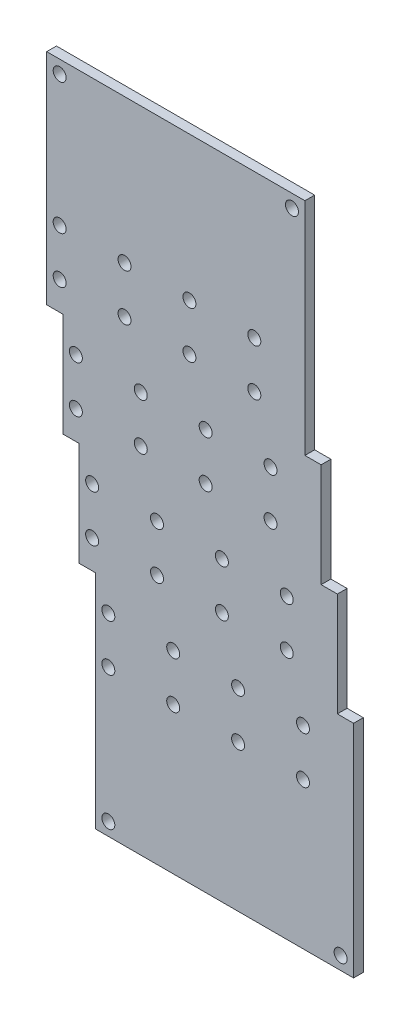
from build123d import *

# Parameters (mm, degrees)
SALIENTE_EXTRUIR1_DEPTH = 1.5
CROQUIS2_R              = 1
CORTAR_EXTRUIR1_DEPTH   = 1.5
CORTAR_EXTRUIR2_REACH   = 112.632
CROQUIS3_R              = 1


with BuildPart() as part:
    # Croquis1 → Saliente-Extruir1 (new body)
    with BuildSketch(Plane.XY):
        Polygon((0, 0), (0, -33.8), (2.5, -33.8), (2.5, -49.8), (5, -49.8), (5, -65.8), (7.5, -65.8), (7.5, -100), (47.3, -100), (47.3, -66), (44.8, -66), (44.8, -50), (42.3, -50), (42.3, -34), (39.8, -34), (39.8, 0), align=None)
    extrude(amount=SALIENTE_EXTRUIR1_DEPTH)

    # Croquis2 → Cortar-Extruir1 (cut)
    with BuildSketch(Plane.XY.offset(1.5)):
        with Locations((2, -22.2)):
            Circle(CROQUIS2_R)
        with Locations((2, -29.4)):
            Circle(CROQUIS2_R)
        with Locations((4.5, -38.2)):
            Circle(CROQUIS2_R)
        with Locations((4.5, -45.4)):
            Circle(CROQUIS2_R)
        with Locations((7, -54.2)):
            Circle(CROQUIS2_R)
        with Locations((7, -61.4)):
            Circle(CROQUIS2_R)
        with Locations((9.5, -70.2)):
            Circle(CROQUIS2_R)
        with Locations((9.5, -77.4)):
            Circle(CROQUIS2_R)
        with Locations((12, -22.2)):
            Circle(CROQUIS2_R)
        with Locations((12, -29.4)):
            Circle(CROQUIS2_R)
        with Locations((14.5, -38.2)):
            Circle(CROQUIS2_R)
        with Locations((14.5, -45.4)):
            Circle(CROQUIS2_R)
        with Locations((17, -54.2)):
            Circle(CROQUIS2_R)
        with Locations((17, -61.4)):
            Circle(CROQUIS2_R)
        with Locations((19.5, -70.2)):
            Circle(CROQUIS2_R)
        with Locations((19.5, -77.4)):
            Circle(CROQUIS2_R)
        with Locations((22, -22.2)):
            Circle(CROQUIS2_R)
        with Locations((22, -29.4)):
            Circle(CROQUIS2_R)
        with Locations((24.5, -38.2)):
            Circle(CROQUIS2_R)
        with Locations((24.5, -45.4)):
            Circle(CROQUIS2_R)
        with Locations((27, -54.2)):
            Circle(CROQUIS2_R)
        with Locations((27, -61.4)):
            Circle(CROQUIS2_R)
        with Locations((29.5, -70.2)):
            Circle(CROQUIS2_R)
        with Locations((29.5, -77.4)):
            Circle(CROQUIS2_R)
        with Locations((32, -22.2)):
            Circle(CROQUIS2_R)
        with Locations((32, -29.4)):
            Circle(CROQUIS2_R)
        with Locations((34.5, -38.2)):
            Circle(CROQUIS2_R)
        with Locations((34.5, -45.4)):
            Circle(CROQUIS2_R)
        with Locations((37, -54.2)):
            Circle(CROQUIS2_R)
        with Locations((37, -61.4)):
            Circle(CROQUIS2_R)
        with Locations((39.5, -70.2)):
            Circle(CROQUIS2_R)
        with Locations((39.5, -77.4)):
            Circle(CROQUIS2_R)
    extrude(amount=-CORTAR_EXTRUIR1_DEPTH, mode=Mode.SUBTRACT)

    # Croquis3 → Cortar-Extruir2 (cut, up to next)
    with BuildSketch(Plane.XY.offset(1.5), mode=Mode.PRIVATE) as cortar_extruir2_sk1:
        with Locations((2, -2)):
            Circle(CROQUIS3_R)
    cortar_extruir2_tool1 = extrude(cortar_extruir2_sk1.sketch, amount=-CORTAR_EXTRUIR2_REACH, mode=Mode.PRIVATE) & part.part
    # Croquis3 → Cortar-Extruir2 (cut, up to next)
    with BuildSketch(Plane.XY.offset(1.5), mode=Mode.PRIVATE) as cortar_extruir2_sk2:
        with Locations((37.8, -2)):
            Circle(CROQUIS3_R)
    cortar_extruir2_tool2 = extrude(cortar_extruir2_sk2.sketch, amount=-CORTAR_EXTRUIR2_REACH, mode=Mode.PRIVATE) & part.part
    # Croquis3 → Cortar-Extruir2 (cut, up to next)
    with BuildSketch(Plane.XY.offset(1.5), mode=Mode.PRIVATE) as cortar_extruir2_sk3:
        with Locations((9.5, -98)):
            Circle(CROQUIS3_R)
    cortar_extruir2_tool3 = extrude(cortar_extruir2_sk3.sketch, amount=-CORTAR_EXTRUIR2_REACH, mode=Mode.PRIVATE) & part.part
    # Croquis3 → Cortar-Extruir2 (cut, up to next)
    with BuildSketch(Plane.XY.offset(1.5), mode=Mode.PRIVATE) as cortar_extruir2_sk4:
        with Locations((45.3, -98)):
            Circle(CROQUIS3_R)
    cortar_extruir2_tool4 = extrude(cortar_extruir2_sk4.sketch, amount=-CORTAR_EXTRUIR2_REACH, mode=Mode.PRIVATE) & part.part
    add(cortar_extruir2_tool1.solids().sort_by_distance((2, -2, 1.5))[0], mode=Mode.SUBTRACT)
    add(cortar_extruir2_tool2.solids().sort_by_distance((37.8, -2, 1.5))[0], mode=Mode.SUBTRACT)
    add(cortar_extruir2_tool3.solids().sort_by_distance((9.5, -98, 1.5))[0], mode=Mode.SUBTRACT)
    add(cortar_extruir2_tool4.solids().sort_by_distance((45.3, -98, 1.5))[0], mode=Mode.SUBTRACT)


solid = part.part
